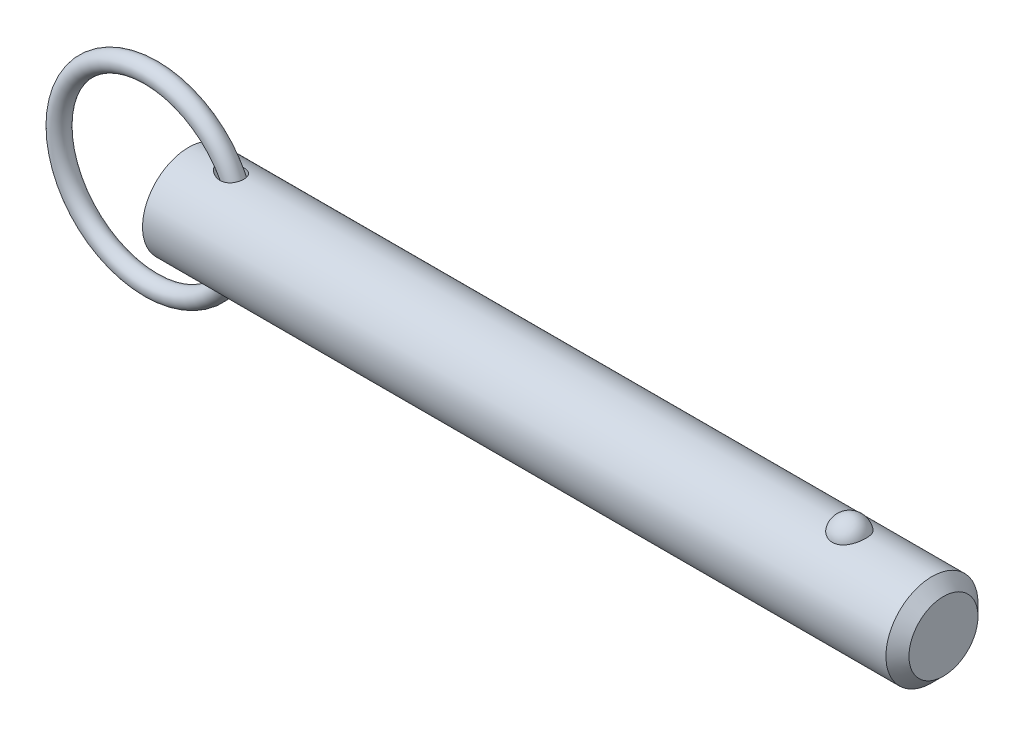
ISO-10303-21;
HEADER;
FILE_DESCRIPTION(('STEP AP214'),'2;1');
FILE_NAME('part.step','',(''),(''),'','','');
FILE_SCHEMA(('AUTOMOTIVE_DESIGN { 1 0 10303 214 1 1 1 1 }'));
ENDSEC;
DATA;
#1=APPLICATION_CONTEXT('core data for automotive mechanical design processes');
#2=APPLICATION_PROTOCOL_DEFINITION('international standard','automotive_design',2000,#1);
#3=PRODUCT_CONTEXT('',#1,'mechanical');
#4=PRODUCT('Part','Part','',(#3));
#5=PRODUCT_RELATED_PRODUCT_CATEGORY('part','',(#4));
#6=PRODUCT_DEFINITION_FORMATION('','',#4);
#7=PRODUCT_DEFINITION_CONTEXT('part definition',#1,'design');
#8=PRODUCT_DEFINITION('design','',#6,#7);
#9=PRODUCT_DEFINITION_SHAPE('','',#8);
#10=(LENGTH_UNIT() NAMED_UNIT(*) SI_UNIT(.MILLI.,.METRE.));
#11=(NAMED_UNIT(*) PLANE_ANGLE_UNIT() SI_UNIT($,.RADIAN.));
#12=(NAMED_UNIT(*) SI_UNIT($,.STERADIAN.) SOLID_ANGLE_UNIT());
#13=UNCERTAINTY_MEASURE_WITH_UNIT(LENGTH_MEASURE(1.E-05),#10,'distance_accuracy_value','');
#14=(GEOMETRIC_REPRESENTATION_CONTEXT(3) GLOBAL_UNCERTAINTY_ASSIGNED_CONTEXT((#13)) GLOBAL_UNIT_ASSIGNED_CONTEXT((#10,
#11,#12)) REPRESENTATION_CONTEXT('',''));
#15=CARTESIAN_POINT('',(0.,0.,0.));
#16=DIRECTION('',(0.,0.,1.));
#17=DIRECTION('',(1.,0.,0.));
#18=AXIS2_PLACEMENT_3D('',#15,#16,#17);
#19=CARTESIAN_POINT('',(-6.46799987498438,0.,0.));
#20=DIRECTION('',(0.,0.,1.));
#21=DIRECTION('',(1.,0.,0.));
#22=AXIS2_PLACEMENT_3D('',#19,#20,#21);
#23=TOROIDAL_SURFACE('',#22,15.875,1.588);
#24=CARTESIAN_POINT('',(10.9950001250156,0.,0.));
#25=VERTEX_POINT('',#24);
#26=VERTEX_LOOP('',#25);
#27=FACE_BOUND('',#26,.T.);
#28=ADVANCED_FACE('P0_F12',(#27),#23,.T.);
#29=CLOSED_SHELL('',(#28));
#30=MANIFOLD_SOLID_BREP('P0_B1',#29);
#31=CARTESIAN_POINT('',(0.,0.,0.));
#32=DIRECTION('',(1.,0.,0.));
#33=DIRECTION('',(0.,0.,-1.));
#34=AXIS2_PLACEMENT_3D('',#31,#32,#33);
#35=CYLINDRICAL_SURFACE('',#34,7.94);
#36=CARTESIAN_POINT('',(5.37881269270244,7.8641200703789,-1.0950869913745));
#37=CARTESIAN_POINT('',(5.49078530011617,7.84653010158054,-1.22142628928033));
#38=CARTESIAN_POINT('',(5.61742164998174,7.82766483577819,-1.33478448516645));
#39=CARTESIAN_POINT('',(5.82155225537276,7.80005811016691,-1.48501770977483));
#40=CARTESIAN_POINT('',(5.89211597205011,7.79095331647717,-1.53186949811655));
#41=CARTESIAN_POINT('',(6.03726296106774,7.77331484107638,-1.61899652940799));
#42=CARTESIAN_POINT('',(6.11184478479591,7.76478095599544,-1.65927412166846));
#43=CARTESIAN_POINT('',(6.31831542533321,7.74290334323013,-1.75933205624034));
#44=CARTESIAN_POINT('',(6.45343253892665,7.73042593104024,-1.81276183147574));
#45=CARTESIAN_POINT('',(6.73017339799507,7.70966096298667,-1.89912673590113));
#46=CARTESIAN_POINT('',(6.87179099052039,7.70136953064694,-1.93208083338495));
#47=CARTESIAN_POINT('',(7.17522096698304,7.6896684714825,-1.97820987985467));
#48=CARTESIAN_POINT('',(7.33750100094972,7.68691980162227,-1.98871513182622));
#49=CARTESIAN_POINT('',(7.5799424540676,7.68880305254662,-1.98137951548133));
#50=CARTESIAN_POINT('',(7.66059155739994,7.69043175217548,-1.97508575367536));
#51=CARTESIAN_POINT('',(7.82077465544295,7.69570110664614,-1.95445819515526));
#52=CARTESIAN_POINT('',(7.90030910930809,7.69934090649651,-1.94012781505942));
#53=CARTESIAN_POINT('',(8.092800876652,7.71066069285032,-1.89475688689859));
#54=CARTESIAN_POINT('',(8.20465204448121,7.71942251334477,-1.85909462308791));
#55=CARTESIAN_POINT('',(8.42059371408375,7.74035594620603,-1.7699066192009));
#56=CARTESIAN_POINT('',(8.52468939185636,7.75252525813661,-1.7163929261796));
#57=CARTESIAN_POINT('',(8.72211003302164,7.77903750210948,-1.59192358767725));
#58=CARTESIAN_POINT('',(8.81539818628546,7.79338749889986,-1.52091076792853));
#59=CARTESIAN_POINT('',(8.98759177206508,7.8225086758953,-1.36321590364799));
#60=CARTESIAN_POINT('',(9.06649712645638,7.83727985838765,-1.27653377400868));
#61=CARTESIAN_POINT('',(9.20311499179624,7.86453692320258,-1.09567667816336));
#62=CARTESIAN_POINT('',(9.26180839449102,7.8771064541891,-1.00225329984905));
#63=CARTESIAN_POINT('',(9.36257622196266,7.89954213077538,-0.806547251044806));
#64=CARTESIAN_POINT('',(9.40465301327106,7.9094086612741,-0.704265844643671));
#65=CARTESIAN_POINT('',(9.47062404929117,7.92520709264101,-0.495461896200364));
#66=CARTESIAN_POINT('',(9.4947881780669,7.9311972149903,-0.38902885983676));
#67=CARTESIAN_POINT('',(9.52544004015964,7.93883641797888,-0.17349446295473));
#68=CARTESIAN_POINT('',(9.53192786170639,7.94048552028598,-0.0643931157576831));
#69=CARTESIAN_POINT('',(9.52707996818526,7.93926454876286,0.153487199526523));
#70=CARTESIAN_POINT('',(9.51572796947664,7.93639034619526,0.262265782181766));
#71=CARTESIAN_POINT('',(9.47542322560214,7.92642470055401,0.47631311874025));
#72=CARTESIAN_POINT('',(9.44647056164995,7.91933327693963,0.581581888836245));
#73=CARTESIAN_POINT('',(9.37164011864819,7.90170355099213,0.785602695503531));
#74=CARTESIAN_POINT('',(9.32576415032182,7.89116561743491,0.884355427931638));
#75=CARTESIAN_POINT('',(9.21823065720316,7.8677977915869,1.07254831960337));
#76=CARTESIAN_POINT('',(9.15657431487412,7.85496807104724,1.16198917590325));
#77=CARTESIAN_POINT('',(9.01919194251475,7.82843688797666,1.32903649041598));
#78=CARTESIAN_POINT('',(8.94347744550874,7.81473614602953,1.40665255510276));
#79=CARTESIAN_POINT('',(8.78012086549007,7.7879321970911,1.5481977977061));
#80=CARTESIAN_POINT('',(8.69247914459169,7.77482897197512,1.61212739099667));
#81=CARTESIAN_POINT('',(8.50642314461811,7.75037063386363,1.72592270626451));
#82=CARTESIAN_POINT('',(8.40786430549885,7.73904540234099,1.77555777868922));
#83=CARTESIAN_POINT('',(8.20398708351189,7.71943979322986,1.85894844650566));
#84=CARTESIAN_POINT('',(8.0986670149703,7.7111601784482,1.89270006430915));
#85=CARTESIAN_POINT('',(7.87703213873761,7.69782475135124,1.94625652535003));
#86=CARTESIAN_POINT('',(7.76044899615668,7.69301557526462,1.96500324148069));
#87=CARTESIAN_POINT('',(7.52574256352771,7.68770484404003,1.98567257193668));
#88=CARTESIAN_POINT('',(7.40761868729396,7.68720497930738,1.98758858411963));
#89=CARTESIAN_POINT('',(7.15639592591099,7.69044495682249,1.97502233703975));
#90=CARTESIAN_POINT('',(7.02341871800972,7.69476380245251,1.9583009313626));
#91=CARTESIAN_POINT('',(6.76125891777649,7.70776394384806,1.90648094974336));
#92=CARTESIAN_POINT('',(6.63208047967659,7.71644984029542,1.87136299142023));
#93=CARTESIAN_POINT('',(6.35978215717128,7.73875442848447,1.77707737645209));
#94=CARTESIAN_POINT('',(6.2177212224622,7.75293863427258,1.71496895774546));
#95=CARTESIAN_POINT('',(5.94559201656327,7.78383102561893,1.56880760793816));
#96=CARTESIAN_POINT('',(5.81552062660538,7.80053855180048,1.48476040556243));
#97=CARTESIAN_POINT('',(5.60081087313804,7.83035955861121,1.31701356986));
#98=CARTESIAN_POINT('',(5.51265224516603,7.84340226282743,1.23780647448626));
#99=CARTESIAN_POINT('',(5.34976240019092,7.86852524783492,1.06647953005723));
#100=CARTESIAN_POINT('',(5.27500719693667,7.88060722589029,0.974383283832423));
#101=CARTESIAN_POINT('',(5.15877594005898,7.89990441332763,0.800548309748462));
#102=CARTESIAN_POINT('',(5.11360209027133,7.90759876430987,0.721348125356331));
#103=CARTESIAN_POINT('',(5.03655060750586,7.92090267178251,0.556518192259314));
#104=CARTESIAN_POINT('',(5.00466157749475,7.92651401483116,0.470894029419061));
#105=CARTESIAN_POINT('',(4.95653766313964,7.93503671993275,0.294356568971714));
#106=CARTESIAN_POINT('',(4.94043621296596,7.93792505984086,0.203404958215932));
#107=CARTESIAN_POINT('',(4.92605720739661,7.94050250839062,0.0200631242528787));
#108=CARTESIAN_POINT('',(4.92776929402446,7.9401934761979,-0.0723262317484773));
#109=CARTESIAN_POINT('',(4.94742735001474,7.93667454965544,-0.243250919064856));
#110=CARTESIAN_POINT('',(4.96327131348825,7.93384031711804,-0.322048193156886));
#111=CARTESIAN_POINT('',(5.00707570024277,7.92609115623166,-0.476058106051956));
#112=CARTESIAN_POINT('',(5.03503965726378,7.92117562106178,-0.55126969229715));
#113=CARTESIAN_POINT('',(5.10737112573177,7.90866290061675,-0.709995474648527));
#114=CARTESIAN_POINT('',(5.15379379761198,7.90074105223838,-0.792541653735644));
#115=CARTESIAN_POINT('',(5.25820836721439,7.88338732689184,-0.949781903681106));
#116=CARTESIAN_POINT('',(5.31621941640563,7.87395295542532,-1.02446265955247));
#117=CARTESIAN_POINT('',(5.37881269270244,7.8641200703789,-1.0950869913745));
#118=B_SPLINE_CURVE_WITH_KNOTS('',3,(#36,#37,#38,#39,#40,#41,#42,#43,#44,#45,#46,#47,#48,#49,
#50,#51,#52,#53,#54,#55,#56,#57,#58,#59,#60,#61,#62,#63,#64,#65,#66,#67,#68,#69,#70,#71,#72,#73,
#74,#75,#76,#77,#78,#79,#80,#81,#82,#83,#84,#85,#86,#87,#88,#89,#90,#91,#92,#93,#94,#95,#96,#97,
#98,#99,#100,#101,#102,#103,#104,#105,#106,#107,#108,#109,#110,#111,#112,#113,#114,#115,#116,
#117),.UNSPECIFIED.,.T.,.F.,(4,2,2,2,2,2,2,2,2,2,2,2,2,2,2,2,2,2,2,2,2,2,2,2,2,2,2,2,2,2,2,2,2,
2,2,2,2,2,2,2,4),(0.,0.508599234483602,0.763935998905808,1.01918131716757,1.45492798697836,
1.89027038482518,2.37502798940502,2.61739702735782,2.8596631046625,3.21120678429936,
3.56251370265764,3.91498401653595,4.26745624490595,4.59897839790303,4.93045331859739,
5.25682643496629,5.58319792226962,5.909867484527,6.23653553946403,6.56316865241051,
6.88977729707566,7.21611917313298,7.54245114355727,7.87378632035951,8.20520442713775,
8.55832700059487,8.91158808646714,9.31234018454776,9.71351536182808,10.1786231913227,
10.6436096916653,11.0001264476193,11.3559986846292,11.6294791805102,11.9027245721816,
12.1782599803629,12.4536351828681,12.693828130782,12.9340911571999,13.2179277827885,
13.5022374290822),.UNSPECIFIED.);
#119=CARTESIAN_POINT('',(5.37881269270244,7.8641200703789,-1.0950869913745));
#120=VERTEX_POINT('',#119);
#121=EDGE_CURVE('P1_E40',#120,#120,#118,.T.);
#122=ORIENTED_EDGE('',*,*,#121,.T.);
#123=EDGE_LOOP('',(#122));
#124=FACE_BOUND('',#123,.T.);
#125=CARTESIAN_POINT('',(128.195,0.,0.));
#126=DIRECTION('',(1.,0.,0.));
#127=DIRECTION('',(0.,0.,-1.));
#128=AXIS2_PLACEMENT_3D('',#125,#126,#127);
#129=CIRCLE('',#128,7.94);
#130=CARTESIAN_POINT('',(128.195,0.,-7.94));
#131=VERTEX_POINT('',#130);
#132=EDGE_CURVE('P1_E25',#131,#131,#129,.T.);
#133=ORIENTED_EDGE('',*,*,#132,.F.);
#134=EDGE_LOOP('',(#133));
#135=FACE_BOUND('',#134,.T.);
#136=CARTESIAN_POINT('',(0.,0.,0.));
#137=DIRECTION('',(1.,0.,0.));
#138=DIRECTION('',(0.,0.,-1.));
#139=AXIS2_PLACEMENT_3D('',#136,#137,#138);
#140=CIRCLE('',#139,7.94);
#141=CARTESIAN_POINT('',(0.,0.,-7.94));
#142=VERTEX_POINT('',#141);
#143=EDGE_CURVE('P1_E9',#142,#142,#140,.T.);
#144=ORIENTED_EDGE('',*,*,#143,.T.);
#145=EDGE_LOOP('',(#144));
#146=FACE_BOUND('',#145,.T.);
#147=CARTESIAN_POINT('',(113.964907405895,7.37767842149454,2.93486986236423));
#148=CARTESIAN_POINT('',(113.812749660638,7.3776732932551,2.93487505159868));
#149=CARTESIAN_POINT('',(113.660632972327,7.38258419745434,2.92262454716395));
#150=CARTESIAN_POINT('',(113.360928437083,7.40163229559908,2.87404196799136));
#151=CARTESIAN_POINT('',(113.213339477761,7.41576720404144,2.83771585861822));
#152=CARTESIAN_POINT('',(112.927018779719,7.4516157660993,2.74218769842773));
#153=CARTESIAN_POINT('',(112.788274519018,7.47331841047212,2.68301886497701));
#154=CARTESIAN_POINT('',(112.522882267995,7.52194082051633,2.54350967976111));
#155=CARTESIAN_POINT('',(112.396236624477,7.5488615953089,2.46316523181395));
#156=CARTESIAN_POINT('',(112.154534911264,7.60594671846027,2.28090375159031));
#157=CARTESIAN_POINT('',(112.039906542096,7.63618114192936,2.17844211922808));
#158=CARTESIAN_POINT('',(111.828878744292,7.69614046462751,1.95608495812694));
#159=CARTESIAN_POINT('',(111.732482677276,7.72586526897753,1.83618622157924));
#160=CARTESIAN_POINT('',(111.555938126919,7.78314821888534,1.57628086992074));
#161=CARTESIAN_POINT('',(111.476707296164,7.81055035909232,1.43561546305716));
#162=CARTESIAN_POINT('',(111.341797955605,7.85879631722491,1.14236334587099));
#163=CARTESIAN_POINT('',(111.286121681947,7.87963951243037,0.98977550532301));
#164=CARTESIAN_POINT('',(111.19881215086,7.91289645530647,0.674619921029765));
#165=CARTESIAN_POINT('',(111.16753090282,7.925186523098,0.511941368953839));
#166=CARTESIAN_POINT('',(111.130975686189,7.93958930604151,0.183247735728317));
#167=CARTESIAN_POINT('',(111.125701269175,7.94170219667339,0.0172327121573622));
#168=CARTESIAN_POINT('',(111.141231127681,7.93554931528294,-0.312672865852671));
#169=CARTESIAN_POINT('',(111.161925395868,7.92732732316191,-0.4765694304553));
#170=CARTESIAN_POINT('',(111.22878655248,7.90141534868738,-0.798305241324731));
#171=CARTESIAN_POINT('',(111.274953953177,7.88372517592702,-0.956144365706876));
#172=CARTESIAN_POINT('',(111.391898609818,7.84066230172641,-1.26152073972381));
#173=CARTESIAN_POINT('',(111.462704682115,7.81528060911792,-1.40904568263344));
#174=CARTESIAN_POINT('',(111.627478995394,7.7594867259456,-1.68950598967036));
#175=CARTESIAN_POINT('',(111.721448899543,7.72907417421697,-1.82244030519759));
#176=CARTESIAN_POINT('',(111.930839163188,7.66640424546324,-2.07032792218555));
#177=CARTESIAN_POINT('',(112.046315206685,7.63414223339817,-2.1852330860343));
#178=CARTESIAN_POINT('',(112.2959006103,7.57149681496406,-2.39329737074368));
#179=CARTESIAN_POINT('',(112.430008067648,7.54111321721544,-2.48645870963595));
#180=CARTESIAN_POINT('',(112.710111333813,7.48650742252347,-2.64628132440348));
#181=CARTESIAN_POINT('',(112.855760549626,7.46215900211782,-2.71350554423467));
#182=CARTESIAN_POINT('',(113.157425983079,7.42171253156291,-2.82226614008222));
#183=CARTESIAN_POINT('',(113.313438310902,7.40561140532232,-2.86381209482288));
#184=CARTESIAN_POINT('',(113.622970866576,7.3842679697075,-2.9183907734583));
#185=CARTESIAN_POINT('',(113.776222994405,7.37852109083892,-2.93275024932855));
#186=CARTESIAN_POINT('',(114.083070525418,7.37700973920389,-2.93655208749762));
#187=CARTESIAN_POINT('',(114.236665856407,7.38124333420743,-2.92599927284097));
#188=CARTESIAN_POINT('',(114.534990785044,7.39890635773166,-2.88102897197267));
#189=CARTESIAN_POINT('',(114.679848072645,7.41205491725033,-2.8473399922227));
#190=CARTESIAN_POINT('',(114.96164329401,7.445801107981,-2.75788206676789));
#191=CARTESIAN_POINT('',(115.098580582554,7.46639934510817,-2.70211132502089));
#192=CARTESIAN_POINT('',(115.364061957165,7.51339098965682,-2.56858908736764));
#193=CARTESIAN_POINT('',(115.492354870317,7.53990200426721,-2.49038067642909));
#194=CARTESIAN_POINT('',(115.734244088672,7.59569503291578,-2.31462737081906));
#195=CARTESIAN_POINT('',(115.847837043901,7.6249776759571,-2.21707808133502));
#196=CARTESIAN_POINT('',(116.06322156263,7.68489473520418,-1.99982049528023));
#197=CARTESIAN_POINT('',(116.164148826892,7.71552419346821,-1.87925337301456));
#198=CARTESIAN_POINT('',(116.345186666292,7.77353016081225,-1.62268826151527));
#199=CARTESIAN_POINT('',(116.425293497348,7.80090608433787,-1.4866875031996));
#200=CARTESIAN_POINT('',(116.565361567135,7.85047992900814,-1.19818413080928));
#201=CARTESIAN_POINT('',(116.624587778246,7.8724818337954,-1.04529016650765));
#202=CARTESIAN_POINT('',(116.717982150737,7.90785114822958,-0.731080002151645));
#203=CARTESIAN_POINT('',(116.752149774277,7.92121837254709,-0.569763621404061));
#204=CARTESIAN_POINT('',(116.794795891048,7.93797834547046,-0.242812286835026));
#205=CARTESIAN_POINT('',(116.803204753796,7.94134405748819,-0.0771668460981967));
#206=CARTESIAN_POINT('',(116.793962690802,7.93767937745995,0.253276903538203));
#207=CARTESIAN_POINT('',(116.776312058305,7.93064910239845,0.418075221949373));
#208=CARTESIAN_POINT('',(116.715424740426,7.90695571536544,0.741525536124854));
#209=CARTESIAN_POINT('',(116.672281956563,7.8903279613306,0.900197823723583));
#210=CARTESIAN_POINT('',(116.56135358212,7.84916386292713,1.20759654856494));
#211=CARTESIAN_POINT('',(116.49356656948,7.82462706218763,1.35632241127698));
#212=CARTESIAN_POINT('',(116.334371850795,7.7700669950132,1.64032869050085));
#213=CARTESIAN_POINT('',(116.242861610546,7.7400200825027,1.77554712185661));
#214=CARTESIAN_POINT('',(116.038296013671,7.67774175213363,2.02800648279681));
#215=CARTESIAN_POINT('',(115.925241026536,7.64551037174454,2.14524772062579));
#216=CARTESIAN_POINT('',(115.680831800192,7.58265895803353,2.35778002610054));
#217=CARTESIAN_POINT('',(115.549583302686,7.55203092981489,2.45319004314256));
#218=CARTESIAN_POINT('',(115.271601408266,7.49579792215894,2.61999897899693));
#219=CARTESIAN_POINT('',(115.124867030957,7.47019326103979,2.69139637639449));
#220=CARTESIAN_POINT('',(114.812947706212,7.42622216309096,2.8105324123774));
#221=CARTESIAN_POINT('',(114.647220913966,7.40825002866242,2.85700910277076));
#222=CARTESIAN_POINT('',(114.309279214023,7.38398348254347,2.9191685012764));
#223=CARTESIAN_POINT('',(114.13706702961,7.3776842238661,2.93486399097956));
#224=CARTESIAN_POINT('',(113.964907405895,7.37767842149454,2.93486986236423));
#225=B_SPLINE_CURVE_WITH_KNOTS('',3,(#147,#148,#149,#150,#151,#152,#153,#154,#155,#156,#157,
#158,#159,#160,#161,#162,#163,#164,#165,#166,#167,#168,#169,#170,#171,#172,#173,#174,#175,#176,
#177,#178,#179,#180,#181,#182,#183,#184,#185,#186,#187,#188,#189,#190,#191,#192,#193,#194,#195,
#196,#197,#198,#199,#200,#201,#202,#203,#204,#205,#206,#207,#208,#209,#210,#211,#212,#213,#214,
#215,#216,#217,#218,#219,#220,#221,#222,#223,#224),.UNSPECIFIED.,.T.,.F.,(4,2,2,2,2,2,2,2,2,2,2,
2,2,2,2,2,2,2,2,2,2,2,2,2,2,2,2,2,2,2,2,2,2,2,2,2,2,2,4),(0.,0.45584132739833,0.911569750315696,
1.36663794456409,1.8217942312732,2.28978983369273,2.7578716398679,3.246853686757,
3.73588214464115,4.23184282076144,4.72779494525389,5.22165321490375,5.71552141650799,
6.20996917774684,6.70445245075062,7.20023431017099,7.69596557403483,8.18023418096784,
8.66432203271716,9.12410697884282,9.58380291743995,10.0296503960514,10.4755341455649,
10.9312349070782,11.3870393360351,11.8654416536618,12.3439299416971,12.8378875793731,
13.3318558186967,13.8271581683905,14.3224549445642,14.8159385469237,15.3094506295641,
15.8051323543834,16.3008055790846,16.7937101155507,17.2866458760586,17.8026240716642,
18.3183879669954),.UNSPECIFIED.);
#226=CARTESIAN_POINT('',(113.964907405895,7.37767842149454,2.93486986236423));
#227=VERTEX_POINT('',#226);
#228=EDGE_CURVE('P1_E34',#227,#227,#225,.T.);
#229=ORIENTED_EDGE('',*,*,#228,.T.);
#230=EDGE_LOOP('',(#229));
#231=FACE_BOUND('',#230,.T.);
#232=CARTESIAN_POINT('',(5.37881269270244,-7.8641200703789,-1.0950869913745));
#233=CARTESIAN_POINT('',(5.31532711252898,-7.87409326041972,-1.02345575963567));
#234=CARTESIAN_POINT('',(5.25654962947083,-7.88365715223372,-0.947641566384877));
#235=CARTESIAN_POINT('',(5.15093536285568,-7.90122221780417,-0.787865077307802));
#236=CARTESIAN_POINT('',(5.10408931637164,-7.90922460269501,-0.703909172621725));
#237=CARTESIAN_POINT('',(5.02499142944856,-7.92292057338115,-0.5279916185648));
#238=CARTESIAN_POINT('',(4.99290048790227,-7.92858863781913,-0.435954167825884));
#239=CARTESIAN_POINT('',(4.94718343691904,-7.93670712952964,-0.247266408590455));
#240=CARTESIAN_POINT('',(4.93353142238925,-7.93916207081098,-0.150622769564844));
#241=CARTESIAN_POINT('',(4.92669426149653,-7.94038957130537,0.0306459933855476));
#242=CARTESIAN_POINT('',(4.9310562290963,-7.93960347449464,0.115182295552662));
#243=CARTESIAN_POINT('',(4.95441758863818,-7.93542535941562,0.2821331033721));
#244=CARTESIAN_POINT('',(4.97342060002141,-7.93203269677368,0.364547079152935));
#245=CARTESIAN_POINT('',(5.02337664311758,-7.92322764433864,0.521528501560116));
#246=CARTESIAN_POINT('',(5.05377582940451,-7.91790920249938,0.596281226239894));
#247=CARTESIAN_POINT('',(5.1246872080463,-7.90571364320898,0.740640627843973));
#248=CARTESIAN_POINT('',(5.16520358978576,-7.89883588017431,0.810245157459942));
#249=CARTESIAN_POINT('',(5.27792634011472,-7.88012470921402,0.97862022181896));
#250=CARTESIAN_POINT('',(5.35563200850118,-7.86757912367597,1.07363778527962));
#251=CARTESIAN_POINT('',(5.52523836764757,-7.84150676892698,1.24994147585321));
#252=CARTESIAN_POINT('',(5.61717506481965,-7.82797755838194,1.33119164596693));
#253=CARTESIAN_POINT('',(5.83913717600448,-7.79742756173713,1.50104748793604));
#254=CARTESIAN_POINT('',(5.97257429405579,-7.78050347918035,1.58521567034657));
#255=CARTESIAN_POINT('',(6.25160600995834,-7.74942135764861,1.73078109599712));
#256=CARTESIAN_POINT('',(6.39720857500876,-7.73526515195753,1.79216327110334));
#257=CARTESIAN_POINT('',(6.69793322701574,-7.7116170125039,1.89134478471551));
#258=CARTESIAN_POINT('',(6.85312134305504,-7.70216275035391,1.92895428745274));
#259=CARTESIAN_POINT('',(7.16781951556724,-7.68988337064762,1.97736316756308));
#260=CARTESIAN_POINT('',(7.32732244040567,-7.68704791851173,1.98820434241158));
#261=CARTESIAN_POINT('',(7.61290770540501,-7.68890797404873,1.98097687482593));
#262=CARTESIAN_POINT('',(7.73913797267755,-7.69217875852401,1.96837928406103));
#263=CARTESIAN_POINT('',(7.98774248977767,-7.70364253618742,1.92303262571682));
#264=CARTESIAN_POINT('',(8.11011880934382,-7.71183283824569,1.89029457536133));
#265=CARTESIAN_POINT('',(8.34766306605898,-7.73253074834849,1.80375920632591));
#266=CARTESIAN_POINT('',(8.46278682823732,-7.74506226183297,1.74984505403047));
#267=CARTESIAN_POINT('',(8.6806268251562,-7.77294147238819,1.62149891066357));
#268=CARTESIAN_POINT('',(8.78334736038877,-7.78828818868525,1.54707406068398));
#269=CARTESIAN_POINT('',(8.96275951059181,-7.81808719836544,1.38814746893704));
#270=CARTESIAN_POINT('',(9.04102925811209,-7.83247448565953,1.30540890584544));
#271=CARTESIAN_POINT('',(9.18176824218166,-7.86008608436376,1.1272733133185));
#272=CARTESIAN_POINT('',(9.24424163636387,-7.87331070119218,1.03187962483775));
#273=CARTESIAN_POINT('',(9.34924815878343,-7.89649032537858,0.83568428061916));
#274=CARTESIAN_POINT('',(9.39252490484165,-7.90656172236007,0.735293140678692));
#275=CARTESIAN_POINT('',(9.46188913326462,-7.92307290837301,0.528458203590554));
#276=CARTESIAN_POINT('',(9.48797767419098,-7.92951292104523,0.422014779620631));
#277=CARTESIAN_POINT('',(9.52228670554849,-7.93804067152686,0.206589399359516));
#278=CARTESIAN_POINT('',(9.53058328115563,-7.94014694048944,0.0976202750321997));
#279=CARTESIAN_POINT('',(9.52935292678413,-7.93983698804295,-0.120212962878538));
#280=CARTESIAN_POINT('',(9.51982577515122,-7.93742071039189,-0.229077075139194));
#281=CARTESIAN_POINT('',(9.48313466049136,-7.92831916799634,-0.443751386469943));
#282=CARTESIAN_POINT('',(9.45594838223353,-7.92162850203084,-0.549557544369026));
#283=CARTESIAN_POINT('',(9.38454658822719,-7.90469917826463,-0.754954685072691));
#284=CARTESIAN_POINT('',(9.34033171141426,-7.89446065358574,-0.854545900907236));
#285=CARTESIAN_POINT('',(9.23602927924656,-7.87157146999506,-1.04456732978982));
#286=CARTESIAN_POINT('',(9.17596171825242,-7.85892385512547,-1.13500888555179));
#287=CARTESIAN_POINT('',(9.0415343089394,-7.83259746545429,-1.30436780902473));
#288=CARTESIAN_POINT('',(8.96717562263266,-7.81891877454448,-1.38328611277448));
#289=CARTESIAN_POINT('',(8.80603455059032,-7.79196869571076,-1.52782923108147));
#290=CARTESIAN_POINT('',(8.71921490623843,-7.77869867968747,-1.59341269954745));
#291=CARTESIAN_POINT('',(8.53589430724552,-7.7539823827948,-1.7096493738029));
#292=CARTESIAN_POINT('',(8.43939269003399,-7.74253622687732,-1.76030155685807));
#293=CARTESIAN_POINT('',(8.23614706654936,-7.72219212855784,-1.84754820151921));
#294=CARTESIAN_POINT('',(8.1291686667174,-7.71339202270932,-1.88361685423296));
#295=CARTESIAN_POINT('',(7.91082287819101,-7.69955300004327,-1.93940887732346));
#296=CARTESIAN_POINT('',(7.79945379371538,-7.69451555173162,-1.95912586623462));
#297=CARTESIAN_POINT('',(7.56409927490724,-7.6881073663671,-1.98413612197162));
#298=CARTESIAN_POINT('',(7.43993744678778,-7.68713944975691,-1.98784574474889));
#299=CARTESIAN_POINT('',(7.19239878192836,-7.68969629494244,-1.97792309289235));
#300=CARTESIAN_POINT('',(7.0690222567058,-7.69322274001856,-1.96428432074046));
#301=CARTESIAN_POINT('',(6.80624991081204,-7.70498367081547,-1.91768089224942));
#302=CARTESIAN_POINT('',(6.66736121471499,-7.71386737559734,-1.88203087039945));
#303=CARTESIAN_POINT('',(6.39625444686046,-7.73551250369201,-1.79098714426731));
#304=CARTESIAN_POINT('',(6.26404857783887,-7.74828074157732,-1.73555871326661));
#305=CARTESIAN_POINT('',(6.06559048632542,-7.77003865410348,-1.63446133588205));
#306=CARTESIAN_POINT('',(5.99591479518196,-7.77821880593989,-1.59522999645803));
#307=CARTESIAN_POINT('',(5.86025875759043,-7.79503524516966,-1.51091846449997));
#308=CARTESIAN_POINT('',(5.79427944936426,-7.8036716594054,-1.46583664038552));
#309=CARTESIAN_POINT('',(5.60322733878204,-7.82978128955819,-1.3219827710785));
#310=CARTESIAN_POINT('',(5.4844964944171,-7.84751780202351,-1.21433077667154));
#311=CARTESIAN_POINT('',(5.37881269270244,-7.8641200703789,-1.0950869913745));
#312=B_SPLINE_CURVE_WITH_KNOTS('',3,(#232,#233,#234,#235,#236,#237,#238,#239,#240,#241,#242,
#243,#244,#245,#246,#247,#248,#249,#250,#251,#252,#253,#254,#255,#256,#257,#258,#259,#260,#261,
#262,#263,#264,#265,#266,#267,#268,#269,#270,#271,#272,#273,#274,#275,#276,#277,#278,#279,#280,
#281,#282,#283,#284,#285,#286,#287,#288,#289,#290,#291,#292,#293,#294,#295,#296,#297,#298,#299,
#300,#301,#302,#303,#304,#305,#306,#307,#308,#309,#310,#311),.UNSPECIFIED.,.T.,.F.,(4,2,2,2,2,2,
2,2,2,2,2,2,2,2,2,2,2,2,2,2,2,2,2,2,2,2,2,2,2,2,2,2,2,2,2,2,2,2,2,4),(0.,0.288363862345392,
0.576503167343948,0.867714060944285,1.15851540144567,1.41111828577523,1.66378363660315,
1.90549406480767,2.1473047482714,2.51540453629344,2.88445136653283,3.35805159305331,
3.83196445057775,4.30961543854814,4.78652012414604,5.16565662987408,5.54458592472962,
5.92563591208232,6.30655339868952,6.64920782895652,6.99177197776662,7.31956587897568,
7.64733959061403,7.97370879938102,8.30008206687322,8.62686856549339,8.95364280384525,
9.28000684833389,9.60634436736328,9.93367879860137,10.261035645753,10.59932199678,
10.9377403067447,11.308967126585,11.6803330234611,12.1096921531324,12.5398088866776,
12.7806650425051,13.0215885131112,13.5016249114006),.UNSPECIFIED.);
#313=CARTESIAN_POINT('',(5.37881269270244,-7.8641200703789,-1.0950869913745));
#314=VERTEX_POINT('',#313);
#315=EDGE_CURVE('P1_E17',#314,#314,#312,.T.);
#316=ORIENTED_EDGE('',*,*,#315,.T.);
#317=EDGE_LOOP('',(#316));
#318=FACE_BOUND('',#317,.T.);
#319=ADVANCED_FACE('P1_F13',(#124,#135,#146,#231,#318),#35,.T.);
#320=CARTESIAN_POINT('',(0.,0.,0.));
#321=DIRECTION('',(-1.,0.,0.));
#322=DIRECTION('',(0.,0.,1.));
#323=AXIS2_PLACEMENT_3D('',#320,#321,#322);
#324=PLANE('',#323);
#325=ORIENTED_EDGE('',*,*,#143,.F.);
#326=EDGE_LOOP('',(#325));
#327=FACE_BOUND('',#326,.T.);
#328=ADVANCED_FACE('P1_F15',(#327),#324,.T.);
#329=CARTESIAN_POINT('',(130.18,0.,0.));
#330=DIRECTION('',(-1.,0.,0.));
#331=DIRECTION('',(0.,0.,1.));
#332=AXIS2_PLACEMENT_3D('',#329,#330,#331);
#333=CONICAL_SURFACE('',#332,5.95500000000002,0.785398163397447);
#334=ORIENTED_EDGE('',*,*,#132,.T.);
#335=EDGE_LOOP('',(#334));
#336=FACE_BOUND('',#335,.T.);
#337=CARTESIAN_POINT('',(130.18,0.,0.));
#338=DIRECTION('',(1.,0.,0.));
#339=DIRECTION('',(0.,0.,-1.));
#340=AXIS2_PLACEMENT_3D('',#337,#338,#339);
#341=CIRCLE('',#340,5.95500000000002);
#342=CARTESIAN_POINT('',(130.18,0.,-5.95500000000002));
#343=VERTEX_POINT('',#342);
#344=EDGE_CURVE('P1_E30',#343,#343,#341,.T.);
#345=ORIENTED_EDGE('',*,*,#344,.F.);
#346=EDGE_LOOP('',(#345));
#347=FACE_BOUND('',#346,.T.);
#348=ADVANCED_FACE('P1_F55',(#336,#347),#333,.T.);
#349=CARTESIAN_POINT('',(130.18,5.95500000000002,0.));
#350=DIRECTION('',(1.,0.,0.));
#351=DIRECTION('',(0.,0.,-1.));
#352=AXIS2_PLACEMENT_3D('',#349,#350,#351);
#353=PLANE('',#352);
#354=ORIENTED_EDGE('',*,*,#344,.T.);
#355=EDGE_LOOP('',(#354));
#356=FACE_BOUND('',#355,.T.);
#357=ADVANCED_FACE('P1_F51',(#356),#353,.T.);
#358=CARTESIAN_POINT('',(113.964907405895,7.146,0.));
#359=DIRECTION('',(-1.,0.,0.));
#360=DIRECTION('',(0.,1.,0.));
#361=AXIS2_PLACEMENT_3D('',#358,#359,#360);
#362=SPHERICAL_SURFACE('',#361,2.944);
#363=ORIENTED_EDGE('',*,*,#228,.F.);
#364=EDGE_LOOP('',(#363));
#365=FACE_BOUND('',#364,.T.);
#366=ADVANCED_FACE('P1_F46',(#365),#362,.T.);
#367=CARTESIAN_POINT('',(-6.46799987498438,0.,0.));
#368=DIRECTION('',(0.,0.,1.));
#369=DIRECTION('',(1.,0.,0.));
#370=AXIS2_PLACEMENT_3D('',#367,#368,#369);
#371=TOROIDAL_SURFACE('',#370,15.875,1.985);
#372=ORIENTED_EDGE('',*,*,#315,.F.);
#373=EDGE_LOOP('',(#372));
#374=FACE_BOUND('',#373,.T.);
#375=ORIENTED_EDGE('',*,*,#121,.F.);
#376=EDGE_LOOP('',(#375));
#377=FACE_BOUND('',#376,.T.);
#378=ADVANCED_FACE('P1_F50',(#374,#377),#371,.F.);
#379=CLOSED_SHELL('',(#319,#328,#348,#357,#366,#378));
#380=MANIFOLD_SOLID_BREP('P1_B1',#379);
#381=ADVANCED_BREP_SHAPE_REPRESENTATION('',(#18,#30,#380),#14);
#382=SHAPE_DEFINITION_REPRESENTATION(#9,#381);
ENDSEC;
END-ISO-10303-21;
